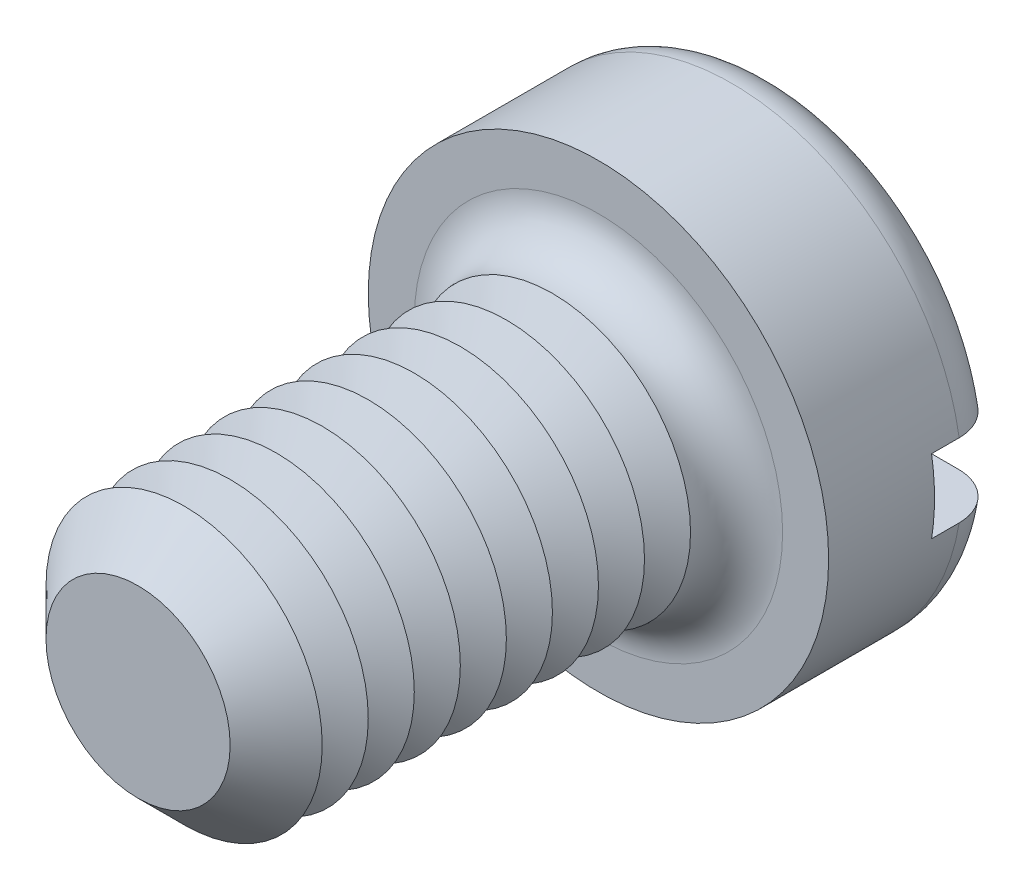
from build123d import *

# Parameters (mm, degrees)
SKETCH3_R           = 5
BOSS_EXTRUDE2_DEPTH = 3.9
SKETCH4_R           = 3
BOSS_EXTRUDE3_DEPTH = 10
FILLET1_R           = 1
CHAMFER1_SIZE       = 1
LPATTERN1_COUNT     = 8
LPATTERN1_PITCH     = 1
SKETCH8_W           = 10
SKETCH8_H           = 1.6
CUT_EXTRUDE1_DEPTH  = 1.6


with BuildPart() as part:
    # Sketch3 → Boss-Extrude2 (new body)
    with BuildSketch(Plane.XY):
        Circle(SKETCH3_R)
    extrude(amount=-BOSS_EXTRUDE2_DEPTH)

    # Sketch4 → Boss-Extrude3 (add)
    with BuildSketch(Plane.XY):
        Circle(SKETCH4_R)
    extrude(amount=BOSS_EXTRUDE3_DEPTH)

    # Fillet1
    fillet1_edges = [part.edges().sort_by_distance(p)[0] for p in [
        (-5, 0, -3.9),
        (-3, 0, 0),
    ]]
    fillet(fillet1_edges, radius=FILLET1_R)

    # Chamfer1
    chamfer1_edges = [part.edges().sort_by_distance(p)[0] for p in [
        (-3, 0, 10),
    ]]
    chamfer(chamfer1_edges, length=CHAMFER1_SIZE)

    # Sketch6 → Cut-Revolve1 (revolve, cut)
    with BuildSketch(Plane(origin=(0, 0, 0), x_dir=(0, 0, -1), z_dir=(1, 0, 0)), mode=Mode.PRIVATE) as cut_revolve1_sk:
        Polygon((-1, 3), (-1.5, 2.133974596), (-2, 3), align=None)
    cut_revolve1 = revolve(cut_revolve1_sk.sketch.rotate(Axis((0, 0, -1.694361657), (0, 0, 1)), 90), axis=Axis((0, 0, -1.694361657), (0, 0, 1)), mode=Mode.SUBTRACT)

    # LPattern1: Cut-Revolve1 ×8
    with Locations(*[(0, 0, i * LPATTERN1_PITCH) for i in range(1, LPATTERN1_COUNT)]):
        add(cut_revolve1, mode=Mode.SUBTRACT)

    # Sketch8 → Cut-Extrude1 (cut)
    with BuildSketch(Plane(origin=(0, 0, -3.9), x_dir=(-1, 0, 0), z_dir=(0, 0, -1))):
        Rectangle(SKETCH8_W, SKETCH8_H)
    extrude(amount=-CUT_EXTRUDE1_DEPTH, mode=Mode.SUBTRACT)


solid = part.part
